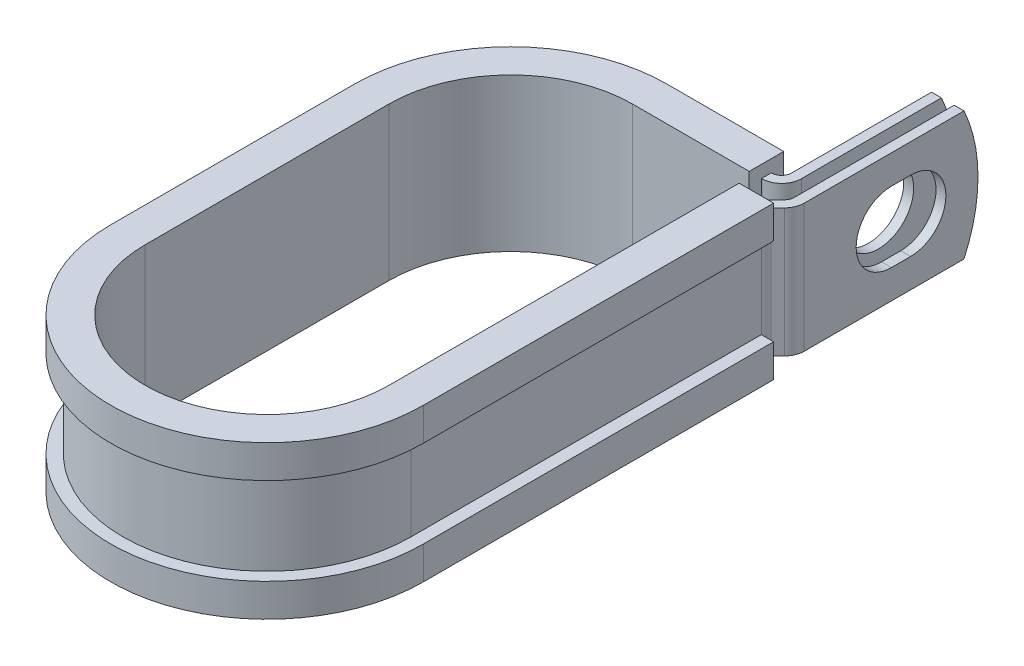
from build123d import *

# Parameters (mm, degrees)
EXTRUDE_THIN1_DEPTH = 7.9375
SKETCH2_R           = 4.3561
CUT_EXTRUDE1_DEPTH  = 1.2192
CUT_EXTRUDE2_DEPTH  = 1.2192
CUT_EXTRUDE3_DEPTH  = 60.055442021


with BuildPart() as part:
    # Sketch1 → Extrude-Thin1 (new, symmetric)
    with BuildSketch(Plane(origin=(0, 0, 0), x_dir=(1, 0, 0), z_dir=(0, 1, 0))):
        with BuildLine():
            Line((18.4963698, 38.1), (18.4963698, 16.5989))
            ThreePointArc((18.4963698, 16.5989), (18.403563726, 16.132332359), (18.139274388, 15.736795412))
            Line((18.139274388, 15.736795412), (17.313090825, 14.910611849))
            ThreePointArc((17.313090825, 14.910611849), (16.784512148, 14.119537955), (16.5989, 13.186402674))
            Line((16.5989, 13.186402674), (16.5989, 0))
            Line((16.5989, 0), (16.5989, -30.1498))
            ThreePointArc((16.5989, -30.1498), (0, -46.7487), (-16.5989, -30.1498))
            Line((-16.5989, -30.1498), (-16.5989, 0))
            ThreePointArc((-16.5989, 0), (-11.73719475, 11.73719475), (0, 16.5989))
            Line((0, 16.5989), (14.4831698, 16.5989))
            ThreePointArc((14.4831698, 16.5989), (16.207378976, 17.313090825), (16.9215698, 19.0373))
            Line((16.9215698, 19.0373), (16.9215698, 38.1))
            Line((16.9215698, 38.1), (15.7023698, 38.1))
            Line((15.7023698, 38.1), (15.7023698, 19.0373))
            ThreePointArc((15.7023698, 19.0373), (15.345274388, 18.175195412), (14.4831698, 17.8181))
            Line((14.4831698, 17.8181), (0, 17.8181))
            ThreePointArc((0, 17.8181), (-12.599299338, 12.599299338), (-17.8181, 0))
            Line((-17.8181, 0), (-17.8181, -30.1498))
            ThreePointArc((-17.8181, -30.1498), (0, -47.9679), (17.8181, -30.1498))
            Line((17.8181, -30.1498), (17.8181, 0))
            Line((17.8181, 0), (17.8181, 13.186402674))
            ThreePointArc((17.8181, 13.186402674), (17.910906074, 13.652970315), (18.175195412, 14.048507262))
            Line((18.175195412, 14.048507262), (19.001378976, 14.874690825))
            ThreePointArc((19.001378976, 14.874690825), (19.529957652, 15.665764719), (19.7155698, 16.5989))
            Line((19.7155698, 16.5989), (19.7155698, 38.1))
            Line((19.7155698, 38.1), (18.4963698, 38.1))
        make_face()
    extrude(amount=EXTRUDE_THIN1_DEPTH, both=True)

    # Sketch2 → Cut-Extrude1 (cut)
    with BuildSketch(Plane.ZY.offset(-15.7023698)):
        with Locations((-28.575, 0)):
            Circle(SKETCH2_R)
    extrude(amount=-CUT_EXTRUDE1_DEPTH, mode=Mode.SUBTRACT)

    # Sketch3 → Cut-Extrude2 (cut)
    with BuildSketch(Plane(origin=(19.7155698, 0, 0), x_dir=(0, 0, -1), z_dir=(1, 0, 0))):
        with BuildLine():
            Line((27.3812, 4.3561), (29.7688, 4.3561))
            ThreePointArc((29.7688, 4.3561), (34.1249, 0), (29.7688, -4.3561))
            Line((29.7688, -4.3561), (27.3812, -4.3561))
            ThreePointArc((27.3812, -4.3561), (23.0251, 0), (27.3812, 4.3561))
        make_face()
    extrude(amount=-CUT_EXTRUDE2_DEPTH, mode=Mode.SUBTRACT)

    # Sketch4 → Cut-Extrude3 (cut, through all)
    with BuildSketch(Plane.ZY.offset(-15.7023698)):
        with BuildLine():
            Line((-36.367580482, 7.9375), (-38.1, 7.9375))
            Line((-38.1, 7.9375), (-38.1, 0))
            ThreePointArc((-38.1, 0), (-37.661856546, 4.062178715), (-36.367580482, 7.9375))
        make_face()
        with BuildLine():
            ThreePointArc((-36.367580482, -7.9375), (-37.661856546, -4.062178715), (-38.1, 0))
            Line((-38.1, 0), (-38.1, -7.9375))
            Line((-38.1, -7.9375), (-36.367580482, -7.9375))
        make_face()
    extrude(amount=-CUT_EXTRUDE3_DEPTH, mode=Mode.SUBTRACT)

    # Sweep1: sweep along a path in Sketch6
    with BuildLine(Plane(origin=(0, 7.9375, 0), x_dir=(1, 0, 0), z_dir=(0, 1, 0))) as sweep1_path:
        Line((15.0749, 13.186402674), (15.0749, 0))
        Line((15.0749, 0), (15.0749, -30.1498))
        ThreePointArc((15.0749, -30.1498), (0, -45.2247), (-15.0749, -30.1498))
        Line((-15.0749, -30.1498), (-15.0749, 0))
        ThreePointArc((-15.0749, 0), (-10.659564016, 10.659564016), (0, 15.0749))
        Line((0, 15.0749), (14.4323698, 15.0749))
    # Sketch5 → Sweep1 (sweep)
    with BuildSketch(Plane(origin=(0, 0, -13.186402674), x_dir=(-1, 0, 0), z_dir=(0, 0, -1))):
        Polygon((-17.8181, 7.9375), (-16.5989, 7.9375), (-16.5989, -7.9375), (-17.8181, -7.9375), (-17.8181, -5.3975), (-19.3421, -5.3975), (-19.3421, -9.4615), (-15.0749, -9.4615), (-15.0749, 9.4615), (-19.3421, 9.4615), (-19.3421, 5.3975), (-17.8181, 5.3975), align=None)
    sweep(path=sweep1_path.line)


solid = part.part
